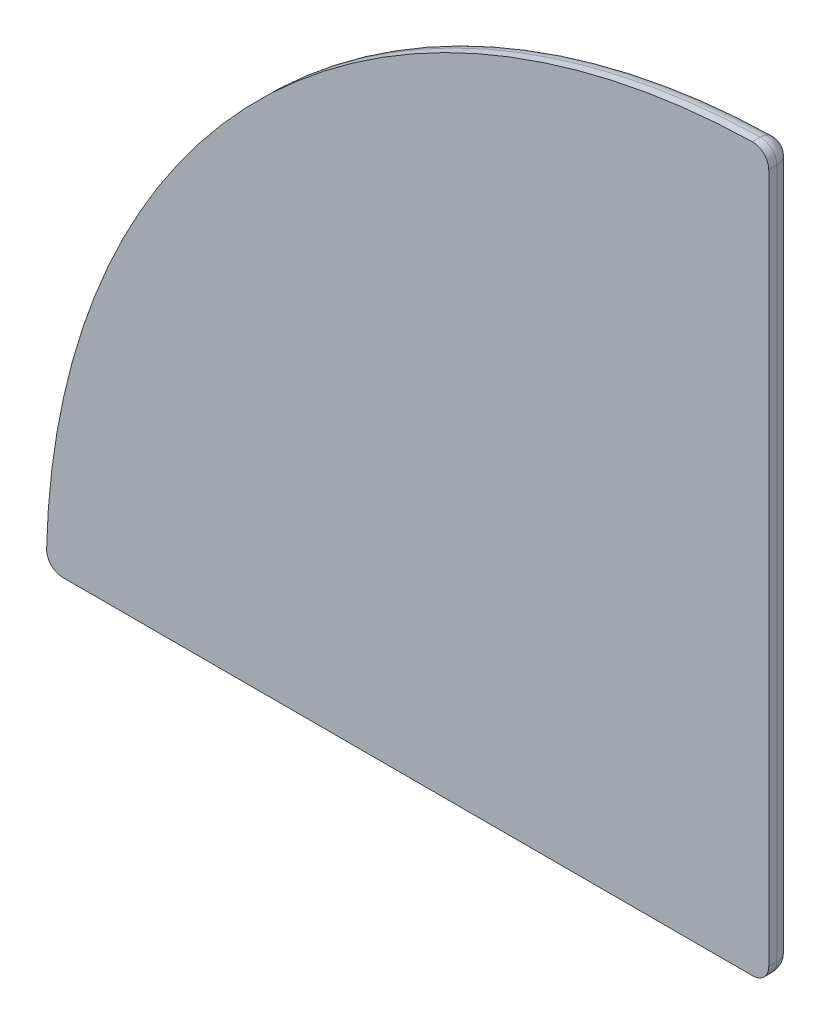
from build123d import *

# Parameters (mm, degrees)
SKETCH1_W          = 90
SKETCH1_H          = 3
REVOLVE1_ANGLE     = 90
FILLET1_R          = 2
CUT_EXTRUDE1_DEPTH = 0.5


with BuildPart() as part:
    # Sketch1 → Revolve1 (revolve)
    with BuildSketch(Plane.XZ):
        with Locations((-45, 1.5)):
            Rectangle(SKETCH1_W, SKETCH1_H)
    revolve(axis=Axis((0, 0, 0), (0, 0, -1)), revolution_arc=REVOLVE1_ANGLE)

    # Fillet1
    fillet1_edges = [part.edges().sort_by_distance(p)[0] for p in [
        (0, 90, 1.5),
        (0, 45, 0),
        (-45, 0, 0),
        (-90, 0, 1.5),
        (0, 0, 1.5),
        (-63.639610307, 63.639610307, 0),
    ]]
    fillet(fillet1_edges, radius=FILLET1_R)

    # Sketch3 → Cut-Extrude1 (cut)
    # profile 1 of 8: a face of its own
    with BuildSketch(Plane(origin=(0, 0, 0), x_dir=(-1, 0, 0), z_dir=(0, 0, -1))):
        with BuildLine():
            Line((29.601520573, 41.86171406), (28.720444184, 41.86171406))
            add(Edge.make_bspline(
                [(28.720444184, 41.86171406), (28.695646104, 41.860691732), (28.649408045, 41.858785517), (28.595513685, 41.837038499), (28.560154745, 41.81033552), (28.533359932, 41.785122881), (28.507017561, 41.752955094), (28.490603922, 41.728683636), (28.48194592, 41.715880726)],
                knots=[0, 0, 0, 0, 1.508597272, 2.812903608, 3.465790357, 4.209986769, 5.055789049, 6, 6, 6, 6], degree=3))
            Line((28.48194592, 41.715880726), (28.384723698, 41.715880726))
            Line((28.384723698, 41.715880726), (28.649046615, 42.493658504))
            Line((28.649046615, 42.493658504), (28.746268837, 42.493658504))
            add(Edge.make_bspline(
                [(28.746268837, 42.493658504), (28.746226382, 42.480745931), (28.746148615, 42.457093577), (28.750164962, 42.424317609), (28.759288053, 42.398427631), (28.771417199, 42.377248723), (28.791315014, 42.36378538), (28.815803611, 42.353926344), (28.846887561, 42.349338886), (28.869310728, 42.348357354), (28.88146849, 42.347825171)],
                knots=[0, 0, 0, 0, 1.312084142, 2.403384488, 3.330811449, 4.094288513, 4.829961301, 5.718401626, 6.762925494, 8, 8, 8, 8], degree=3))
            Line((28.88146849, 42.347825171), (30.544120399, 42.347825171))
            Line((30.544120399, 42.347825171), (30.511459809, 42.250602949))
            add(Edge.make_bspline(
                [(30.511459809, 42.250602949), (30.497436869, 42.246587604), (30.470747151, 42.238945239), (30.434238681, 42.2235866), (30.402824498, 42.206995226), (30.367280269, 42.182591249), (30.331274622, 42.139397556), (30.314565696, 42.098042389), (30.305622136, 42.075906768)],
                knots=[0, 0, 0, 0, 0.925466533, 1.761430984, 2.50945134, 3.178501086, 4.489774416, 6, 6, 6, 6], degree=3))
            Line((30.305622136, 42.075906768), (30.077757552, 41.404465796))
            add(Edge.make_bspline(
                [(30.077757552, 41.404465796), (30.074208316, 41.392899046), (30.067729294, 41.371784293), (30.062260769, 41.341070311), (30.063887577, 41.314745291), (30.06958138, 41.291376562), (30.083794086, 41.27224665), (30.10485602, 41.256216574), (30.131935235, 41.241193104), (30.153065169, 41.233745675), (30.164346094, 41.229769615)],
                knots=[0, 0, 0, 0, 1.26366306, 2.306778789, 3.233532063, 4.003346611, 4.78083917, 5.664355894, 6.753038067, 8, 8, 8, 8], degree=3))
            Line((30.164346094, 41.229769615), (30.130925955, 41.132547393))
            add(Edge.make_bspline(
                [(30.130925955, 41.132547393), (30.033084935, 41.086100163), (29.841913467, 40.995346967), (29.555128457, 40.877018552), (29.27698999, 40.77618319), (29.006832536, 40.693637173), (28.744415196, 40.629285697), (28.489990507, 40.583751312), (28.243614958, 40.55472849), (28.081991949, 40.551029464), (28.002670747, 40.54921406)],
                knots=[0, 0, 0, 0, 1.168033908, 2.282220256, 3.344724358, 4.358042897, 5.327706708, 6.25709569, 7.144618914, 8, 8, 8, 8], degree=3))
            add(Edge.make_bspline(
                [(28.002670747, 40.54921406), (27.934258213, 40.550208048), (27.801960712, 40.552130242), (27.610611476, 40.571736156), (27.433011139, 40.601765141), (27.269635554, 40.646582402), (27.118958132, 40.700585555), (26.983715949, 40.770883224), (26.86105599, 40.851568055), (26.790397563, 40.916607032), (26.755491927, 40.948736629)],
                knots=[0, 0, 0, 0, 1.221886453, 2.362907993, 3.433081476, 4.436038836, 5.386387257, 6.286670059, 7.153605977, 8, 8, 8, 8], degree=3))
            add(Edge.make_bspline(
                [(26.755491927, 40.948736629), (26.735392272, 40.969947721), (26.695564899, 41.0119774), (26.642426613, 41.07998492), (26.595154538, 41.150791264), (26.553834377, 41.224520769), (26.519607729, 41.301918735), (26.491395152, 41.3821284), (26.470513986, 41.46564976), (26.454011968, 41.551531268), (26.445357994, 41.640995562), (26.442074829, 41.733362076), (26.446279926, 41.828758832), (26.456267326, 41.927135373), (26.472234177, 42.028560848), (26.494451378, 42.133286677), (26.523199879, 42.240759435), (26.546777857, 42.312738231), (26.558768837, 42.349344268)],
                knots=[0, 0, 0, 0, 0.936532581, 1.855734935, 2.763103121, 3.664349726, 4.561969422, 5.47339582, 6.386988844, 7.320031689, 8.274822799, 9.265753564, 10.281317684, 11.333846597, 12.434938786, 13.571751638, 14.765073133, 16, 16, 16, 16], degree=3))
            add(Edge.make_bspline(
                [(26.558768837, 42.349344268), (26.583615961, 42.417705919), (26.632808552, 42.553049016), (26.727763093, 42.74599041), (26.836316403, 42.928898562), (26.960367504, 43.101217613), (27.100511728, 43.26178164), (27.254104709, 43.413069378), (27.42419321, 43.552445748), (27.546533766, 43.635666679), (27.608465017, 43.677794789)],
                knots=[0, 0, 0, 0, 1.010588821, 2.000774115, 2.984122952, 3.964923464, 4.948026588, 5.943639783, 6.959029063, 8, 8, 8, 8], degree=3))
            add(Edge.make_bspline(
                [(27.608465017, 43.677794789), (27.669671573, 43.715516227), (27.791538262, 43.790622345), (27.984311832, 43.885168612), (28.183184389, 43.96623073), (28.388890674, 44.032128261), (28.601407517, 44.083272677), (28.820477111, 44.119375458), (29.046321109, 44.142027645), (29.199159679, 44.144955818), (29.276433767, 44.146436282)],
                knots=[0, 0, 0, 0, 0.981709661, 1.954655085, 2.929001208, 3.913442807, 4.902509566, 5.912373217, 6.944510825, 8, 8, 8, 8], degree=3))
            add(Edge.make_bspline(
                [(29.276433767, 44.146436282), (29.325057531, 44.145584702), (29.420379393, 44.143915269), (29.559920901, 44.134463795), (29.692762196, 44.116752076), (29.8212004, 44.092310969), (29.949336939, 44.058587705), (30.081549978, 44.0169154), (30.219241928, 43.964873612), (30.31186037, 43.924783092), (30.359550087, 43.904140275)],
                knots=[0, 0, 0, 0, 1.042667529, 2.044041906, 2.996855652, 3.914614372, 4.845525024, 5.836188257, 6.8858421, 8, 8, 8, 8], degree=3))
            add(Edge.make_bspline(
                [(30.359550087, 43.904140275), (30.382723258, 43.893717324), (30.425552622, 43.874453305), (30.486262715, 43.852081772), (30.537930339, 43.837995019), (30.569632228, 43.835404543), (30.583616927, 43.834261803)],
                knots=[0, 0, 0, 0, 1.29097748, 2.386024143, 3.288024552, 4, 4, 4, 4], degree=3))
            add(Edge.make_bspline(
                [(30.583616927, 43.834261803), (30.593575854, 43.835123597), (30.615549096, 43.837025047), (30.649755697, 43.849898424), (30.688840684, 43.868012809), (30.715197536, 43.884559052), (30.729450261, 43.893506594)],
                knots=[0, 0, 0, 0, 0.750766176, 1.65648045, 2.732719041, 4, 4, 4, 4], degree=3))
            Line((30.729450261, 43.893506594), (30.813000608, 43.854769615))
            Line((30.813000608, 43.854769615), (30.114975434, 43.016227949))
            Line((30.114975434, 43.016227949), (30.054211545, 43.055724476))
            add(Edge.make_bspline(
                [(30.054211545, 43.055724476), (30.05786836, 43.069106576), (30.064521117, 43.093452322), (30.072120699, 43.127358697), (30.07434972, 43.155391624), (30.073747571, 43.179397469), (30.065299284, 43.200996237), (30.053361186, 43.223795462), (30.034407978, 43.247961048), (30.019637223, 43.26420242), (30.011676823, 43.272955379)],
                knots=[0, 0, 0, 0, 1.395800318, 2.539347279, 3.484551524, 4.224717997, 4.925283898, 5.791008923, 6.809508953, 8, 8, 8, 8], degree=3))
            add(Edge.make_bspline(
                [(30.011676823, 43.272955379), (29.989434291, 43.292902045), (29.941672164, 43.335734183), (29.852143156, 43.389307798), (29.74286181, 43.436615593), (29.617963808, 43.480351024), (29.483669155, 43.516666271), (29.34661236, 43.543306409), (29.210008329, 43.560017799), (29.11900022, 43.562076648), (29.073634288, 43.563102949)],
                knots=[0, 0, 0, 0, 0.715040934, 1.535431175, 2.48643065, 3.567273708, 4.705518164, 5.818607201, 6.9126143, 8, 8, 8, 8], degree=3))
            add(Edge.make_bspline(
                [(29.073634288, 43.563102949), (29.028023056, 43.562297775), (28.937579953, 43.560701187), (28.803255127, 43.545747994), (28.671817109, 43.521421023), (28.542548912, 43.487853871), (28.416112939, 43.4446784), (28.29227783, 43.391807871), (28.170961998, 43.32968719), (28.093468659, 43.280894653), (28.054320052, 43.25624531)],
                knots=[0, 0, 0, 0, 1.013375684, 2.00943578, 2.999374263, 3.981993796, 4.974886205, 5.96565587, 6.97227632, 8, 8, 8, 8], degree=3))
            add(Edge.make_bspline(
                [(28.054320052, 43.25624531), (28.011545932, 43.226783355), (27.927161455, 43.168661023), (27.810455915, 43.070842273), (27.704951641, 42.965562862), (27.60829542, 42.85453224), (27.52318396, 42.735589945), (27.44853618, 42.609800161), (27.384123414, 42.47715694), (27.349963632, 42.384596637), (27.332748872, 42.337951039)],
                knots=[0, 0, 0, 0, 1.047083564, 2.065678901, 3.065830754, 4.050574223, 5.031178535, 6.011104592, 6.997699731, 8, 8, 8, 8], degree=3))
            add(Edge.make_bspline(
                [(27.332748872, 42.337951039), (27.318749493, 42.293112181), (27.291824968, 42.206875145), (27.266150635, 42.077911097), (27.255998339, 41.955549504), (27.260289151, 41.839453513), (27.278690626, 41.72997876), (27.313885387, 41.627291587), (27.362719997, 41.530623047), (27.406973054, 41.473452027), (27.429211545, 41.444721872)],
                knots=[0, 0, 0, 0, 1.196515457, 2.301217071, 3.343419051, 4.318485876, 5.25515961, 6.16110544, 7.075900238, 8, 8, 8, 8], degree=3))
            add(Edge.make_bspline(
                [(27.429211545, 41.444721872), (27.451813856, 41.419699), (27.49753981, 41.369076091), (27.579737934, 41.305665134), (27.672312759, 41.251921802), (27.775192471, 41.208152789), (27.888534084, 41.173891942), (28.012270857, 41.150319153), (28.146322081, 41.134469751), (28.239347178, 41.133203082), (28.287501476, 41.132547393)],
                knots=[0, 0, 0, 0, 0.856531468, 1.732819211, 2.627732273, 3.574227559, 4.570698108, 5.634421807, 6.7754621, 8, 8, 8, 8], degree=3))
            add(Edge.make_bspline(
                [(28.287501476, 41.132547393), (28.33638506, 41.133583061), (28.435053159, 41.135673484), (28.583989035, 41.147776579), (28.734433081, 41.169629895), (28.885355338, 41.197985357), (29.033370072, 41.234164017), (29.175800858, 41.276407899), (29.310408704, 41.325657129), (29.396131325, 41.363741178), (29.438217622, 41.382438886)],
                knots=[0, 0, 0, 0, 0.989157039, 1.996544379, 3.020928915, 4.063796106, 5.102490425, 6.102465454, 7.068388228, 8, 8, 8, 8], degree=3))
            Line((29.438217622, 41.382438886), (29.601520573, 41.86171406))
        make_face()
    # profile 2 of 8: a face of its own
    with BuildSketch(Plane(origin=(0, 0, 0), x_dir=(-1, 0, 0), z_dir=(0, 0, -1))):
        with BuildLine():
            Line((31.755600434, 41.764491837), (31.454819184, 40.880377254))
            add(Edge.make_bspline(
                [(31.454819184, 40.880377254), (31.451233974, 40.868302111), (31.444661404, 40.846165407), (31.439625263, 40.814191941), (31.440111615, 40.786664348), (31.445646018, 40.762126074), (31.460441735, 40.742363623), (31.479568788, 40.723468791), (31.506895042, 40.708188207), (31.527396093, 40.699628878), (31.538369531, 40.695047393)],
                knots=[0, 0, 0, 0, 1.279442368, 2.345532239, 3.272103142, 4.070919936, 4.848744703, 5.740365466, 6.790502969, 8, 8, 8, 8], degree=3))
            Line((31.538369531, 40.695047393), (31.504949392, 40.597825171))
            Line((31.504949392, 40.597825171), (30.53272717, 40.597825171))
            Line((30.53272717, 40.597825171), (30.566147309, 40.695047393))
            add(Edge.make_bspline(
                [(30.566147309, 40.695047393), (30.579903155, 40.699102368), (30.606294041, 40.706881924), (30.642779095, 40.721970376), (30.674325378, 40.73933686), (30.710293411, 40.766675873), (30.747944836, 40.812965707), (30.765617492, 40.857457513), (30.775023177, 40.881136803)],
                knots=[0, 0, 0, 0, 0.87830476, 1.685046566, 2.414382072, 3.078421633, 4.445086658, 6, 6, 6, 6], degree=3))
            Line((30.775023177, 40.881136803), (31.556598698, 43.182569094))
            add(Edge.make_bspline(
                [(31.556598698, 43.182569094), (31.56052939, 43.194623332), (31.567873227, 43.217144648), (31.572410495, 43.249526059), (31.572098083, 43.277327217), (31.566373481, 43.301320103), (31.552629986, 43.321594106), (31.533288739, 43.340185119), (31.506066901, 43.355534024), (31.48554959, 43.364082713), (31.474567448, 43.368658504)],
                knots=[0, 0, 0, 0, 1.283517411, 2.398036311, 3.296865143, 4.093887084, 4.855825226, 5.745442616, 6.793220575, 8, 8, 8, 8], degree=3))
            Line((31.474567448, 43.368658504), (31.507228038, 43.465880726))
            Line((31.507228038, 43.465880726), (33.369641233, 43.465880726))
            add(Edge.make_bspline(
                [(33.369641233, 43.465880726), (33.399010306, 43.465664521), (33.45572667, 43.465246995), (33.537782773, 43.464044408), (33.613981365, 43.460708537), (33.684412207, 43.457260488), (33.749265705, 43.451980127), (33.808248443, 43.445092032), (33.861450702, 43.437578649), (33.923679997, 43.426837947), (33.994439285, 43.408653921), (34.072434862, 43.378971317), (34.143415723, 43.342114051), (34.184784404, 43.310527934), (34.205144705, 43.294982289)],
                knots=[0, 0, 0, 0, 1.215902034, 2.348100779, 3.397091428, 4.373281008, 5.267226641, 6.090209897, 6.831365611, 7.491368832, 8.704013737, 9.848613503, 10.941158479, 12, 12, 12, 12], degree=3))
            add(Edge.make_bspline(
                [(34.205144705, 43.294982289), (34.223600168, 43.277661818), (34.260332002, 43.243188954), (34.302545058, 43.1795299), (34.331762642, 43.107714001), (34.347013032, 43.02808494), (34.351721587, 42.941142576), (34.342200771, 42.846325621), (34.321703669, 42.74349543), (34.299538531, 42.673732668), (34.287935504, 42.637213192)],
                knots=[0, 0, 0, 0, 0.857133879, 1.705950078, 2.569611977, 3.47329217, 4.446091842, 5.516273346, 6.699816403, 8, 8, 8, 8], degree=3))
            add(Edge.make_bspline(
                [(34.287935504, 42.637213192), (34.277640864, 42.608975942), (34.257367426, 42.553367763), (34.221513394, 42.473349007), (34.181466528, 42.398024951), (34.136319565, 42.327804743), (34.086904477, 42.262197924), (34.032755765, 42.201556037), (33.975137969, 42.144858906), (33.912040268, 42.093683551), (33.843893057, 42.046410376), (33.770038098, 42.00202516), (33.689552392, 41.962241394), (33.603051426, 41.925516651), (33.510594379, 41.892564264), (33.412192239, 41.861754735), (33.307348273, 41.835468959), (33.235007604, 41.820674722), (33.197983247, 41.813102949)],
                knots=[0, 0, 0, 0, 0.998792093, 1.966941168, 2.91198992, 3.831782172, 4.739014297, 5.639192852, 6.531905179, 7.42306907, 8.33590481, 9.287041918, 10.284414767, 11.317643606, 12.409108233, 13.545743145, 14.743897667, 16, 16, 16, 16], degree=3))
            Line((33.197983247, 41.813102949), (33.498764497, 41.063428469))
            add(Edge.make_bspline(
                [(33.498764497, 41.063428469), (33.512182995, 41.032179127), (33.536859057, 40.97471288), (33.574395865, 40.897050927), (33.610773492, 40.836270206), (33.644766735, 40.788374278), (33.682210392, 40.752994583), (33.724714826, 40.727125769), (33.77147064, 40.705954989), (33.805680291, 40.698726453), (33.823091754, 40.695047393)],
                knots=[0, 0, 0, 0, 1.580752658, 2.906938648, 4.004793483, 4.870887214, 5.628500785, 6.379413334, 7.175180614, 8, 8, 8, 8], degree=3))
            Line((33.823091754, 40.695047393), (33.789671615, 40.597825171))
            Line((33.789671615, 40.597825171), (32.494641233, 40.597825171))
            Line((32.494641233, 40.597825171), (32.528061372, 40.695047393))
            add(Edge.make_bspline(
                [(32.528061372, 40.695047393), (32.550957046, 40.700722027), (32.592626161, 40.711049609), (32.644646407, 40.737493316), (32.685527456, 40.766396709), (32.698307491, 40.793351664), (32.704276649, 40.80594149)],
                knots=[0, 0, 0, 0, 1.302264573, 2.370063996, 3.238707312, 4, 4, 4, 4], degree=3))
            add(Edge.make_bspline(
                [(32.704276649, 40.80594149), (32.706649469, 40.816285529), (32.711888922, 40.839126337), (32.70598467, 40.878058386), (32.693880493, 40.923256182), (32.679971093, 40.954475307), (32.672375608, 40.971523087)],
                knots=[0, 0, 0, 0, 0.734497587, 1.621853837, 2.701369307, 4, 4, 4, 4], degree=3))
            Line((32.672375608, 40.971523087), (32.370075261, 41.764491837))
            Line((32.370075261, 41.764491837), (31.755600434, 41.764491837))
        make_face()
        with BuildLine():
            Line((31.937132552, 42.29921406), (32.980752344, 42.29921406))
            add(Edge.make_bspline(
                [(32.980752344, 42.29921406), (33.018264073, 42.299584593), (33.088877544, 42.300282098), (33.187955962, 42.310904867), (33.274511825, 42.324139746), (33.326002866, 42.341356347), (33.349892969, 42.349344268)],
                knots=[0, 0, 0, 0, 1.201770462, 2.262257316, 3.193746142, 4, 4, 4, 4], degree=3))
            add(Edge.make_bspline(
                [(33.349892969, 42.349344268), (33.378817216, 42.361884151), (33.435753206, 42.386568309), (33.50689622, 42.447793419), (33.564561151, 42.524044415), (33.588257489, 42.584065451), (33.600544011, 42.615186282)],
                knots=[0, 0, 0, 0, 0.995730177, 1.960046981, 2.942286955, 4, 4, 4, 4], degree=3))
            add(Edge.make_bspline(
                [(33.600544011, 42.615186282), (33.605212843, 42.629271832), (33.614106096, 42.656102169), (33.621116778, 42.695745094), (33.625825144, 42.731789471), (33.624252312, 42.764623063), (33.618243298, 42.794172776), (33.607714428, 42.820403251), (33.59199503, 42.843080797), (33.571469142, 42.862458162), (33.545809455, 42.879769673), (33.513399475, 42.89245798), (33.475798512, 42.905128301), (33.431691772, 42.914488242), (33.381476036, 42.922081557), (33.324893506, 42.926950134), (33.262354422, 42.931213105), (33.218499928, 42.931177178), (33.195704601, 42.931158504)],
                knots=[0, 0, 0, 0, 1.089736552, 2.075744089, 2.955845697, 3.757392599, 4.480481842, 5.165149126, 5.821108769, 6.492738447, 7.231247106, 8.082103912, 9.041917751, 10.148702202, 11.391681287, 12.775749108, 14.324051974, 16, 16, 16, 16], degree=3))
            Line((33.195704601, 42.931158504), (32.152084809, 42.931158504))
            Line((32.152084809, 42.931158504), (31.937132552, 42.29921406))
        make_face(mode=Mode.SUBTRACT)
    # profile 3 of 8: a face of its own
    with BuildSketch(Plane(origin=(0, 0, 0), x_dir=(-1, 0, 0), z_dir=(0, 0, -1))):
        with BuildLine():
            Line((35.352822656, 41.764491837), (35.137870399, 41.132547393))
            Line((35.137870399, 41.132547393), (36.899263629, 41.132547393))
            add(Edge.make_bspline(
                [(36.899263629, 41.132547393), (36.923055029, 41.133629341), (36.967488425, 41.135650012), (37.019467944, 41.156995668), (37.05448492, 41.18315894), (37.080756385, 41.20917322), (37.107422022, 41.241255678), (37.123803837, 41.265560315), (37.132445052, 41.278380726)],
                knots=[0, 0, 0, 0, 1.471494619, 2.748198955, 3.412112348, 4.179755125, 5.039842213, 6, 6, 6, 6], degree=3))
            Line((37.132445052, 41.278380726), (37.229667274, 41.278380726))
            Line((37.229667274, 41.278380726), (36.948634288, 40.451991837))
            Line((36.948634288, 40.451991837), (36.851412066, 40.451991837))
            add(Edge.make_bspline(
                [(36.851412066, 40.451991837), (36.851819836, 40.464421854), (36.852572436, 40.487363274), (36.847844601, 40.518788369), (36.840294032, 40.545141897), (36.825614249, 40.565151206), (36.80637945, 40.580140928), (36.781737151, 40.591102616), (36.751123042, 40.596466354), (36.728887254, 40.597351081), (36.716971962, 40.597825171)],
                knots=[0, 0, 0, 0, 1.270497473, 2.344889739, 3.24681471, 4.045564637, 4.839248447, 5.721199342, 6.778879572, 8, 8, 8, 8], degree=3))
            Line((36.716971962, 40.597825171), (34.129949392, 40.597825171))
            Line((34.129949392, 40.597825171), (34.163369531, 40.695047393))
            add(Edge.make_bspline(
                [(34.163369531, 40.695047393), (34.177125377, 40.699102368), (34.203516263, 40.706881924), (34.240001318, 40.721970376), (34.271547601, 40.73933686), (34.307515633, 40.766675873), (34.345167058, 40.812965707), (34.362839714, 40.857457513), (34.372245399, 40.881136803)],
                knots=[0, 0, 0, 0, 0.87830476, 1.685046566, 2.414382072, 3.078421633, 4.445086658, 6, 6, 6, 6], degree=3))
            Line((34.372245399, 40.881136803), (35.15382092, 43.182569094))
            add(Edge.make_bspline(
                [(35.15382092, 43.182569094), (35.157751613, 43.194623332), (35.16509545, 43.217144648), (35.169632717, 43.249526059), (35.169320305, 43.277327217), (35.163595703, 43.301320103), (35.149852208, 43.321594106), (35.130510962, 43.340185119), (35.103289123, 43.355534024), (35.082771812, 43.364082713), (35.07178967, 43.368658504)],
                knots=[0, 0, 0, 0, 1.283517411, 2.398036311, 3.296865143, 4.093887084, 4.855825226, 5.745442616, 6.793220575, 8, 8, 8, 8], degree=3))
            Line((35.07178967, 43.368658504), (35.104450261, 43.465880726))
            Line((35.104450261, 43.465880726), (37.593491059, 43.465880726))
            add(Edge.make_bspline(
                [(37.593491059, 43.465880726), (37.617763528, 43.467313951), (37.663103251, 43.469991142), (37.716305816, 43.490793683), (37.751747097, 43.517019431), (37.776952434, 43.543527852), (37.804263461, 43.574382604), (37.819916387, 43.598803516), (37.82819158, 43.61171406)],
                knots=[0, 0, 0, 0, 1.497028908, 2.79637307, 3.456985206, 4.20966196, 5.0535064, 6, 6, 6, 6], degree=3))
            Line((37.82819158, 43.61171406), (37.925413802, 43.61171406))
            Line((37.925413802, 43.61171406), (37.644380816, 42.785325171))
            Line((37.644380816, 42.785325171), (37.547158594, 42.785325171))
            add(Edge.make_bspline(
                [(37.547158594, 42.785325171), (37.547513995, 42.797987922), (37.548170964, 42.821395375), (37.544050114, 42.853644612), (37.534938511, 42.879549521), (37.521737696, 42.900000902), (37.502303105, 42.914487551), (37.477994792, 42.925112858), (37.447047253, 42.929660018), (37.4248751, 42.930627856), (37.41271849, 42.931158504)],
                knots=[0, 0, 0, 0, 1.291887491, 2.388090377, 3.295359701, 4.076497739, 4.83111929, 5.733593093, 6.757368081, 8, 8, 8, 8], degree=3))
            Line((37.41271849, 42.931158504), (35.749307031, 42.931158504))
            Line((35.749307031, 42.931158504), (35.534354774, 42.29921406))
            Line((35.534354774, 42.29921406), (36.566581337, 42.29921406))
            add(Edge.make_bspline(
                [(36.566581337, 42.29921406), (36.589832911, 42.30072293), (36.633905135, 42.303582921), (36.685843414, 42.324233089), (36.72105807, 42.350581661), (36.747091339, 42.376535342), (36.774215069, 42.408153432), (36.790876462, 42.432214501), (36.799762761, 42.445047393)],
                knots=[0, 0, 0, 0, 1.446319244, 2.741427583, 3.407321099, 4.177253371, 5.027844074, 6, 6, 6, 6], degree=3))
            Line((36.799762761, 42.445047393), (36.896984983, 42.445047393))
            Line((36.896984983, 42.445047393), (36.615951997, 41.618658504))
            Line((36.615951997, 41.618658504), (36.518729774, 41.618658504))
            add(Edge.make_bspline(
                [(36.518729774, 41.618658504), (36.518817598, 41.631088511), (36.518979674, 41.654027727), (36.514345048, 41.685687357), (36.5069114, 41.712152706), (36.492992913, 41.732462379), (36.474523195, 41.747915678), (36.449564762, 41.757463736), (36.419247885, 41.763235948), (36.396981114, 41.764053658), (36.385049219, 41.764491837)],
                knots=[0, 0, 0, 0, 1.274023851, 2.351173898, 3.280111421, 4.06600575, 4.841513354, 5.71535005, 6.775745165, 8, 8, 8, 8], degree=3))
            Line((36.385049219, 41.764491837), (35.352822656, 41.764491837))
        make_face()
    # profile 4 of 8: a face of its own
    with BuildSketch(Plane(origin=(0, 0, 0), x_dir=(-1, 0, 0), z_dir=(0, 0, -1))):
        with BuildLine():
            Line((38.706989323, 41.764491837), (38.492037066, 41.132547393))
            Line((38.492037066, 41.132547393), (40.253430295, 41.132547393))
            add(Edge.make_bspline(
                [(40.253430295, 41.132547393), (40.277221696, 41.133629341), (40.321655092, 41.135650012), (40.373634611, 41.156995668), (40.408651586, 41.18315894), (40.434923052, 41.20917322), (40.461588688, 41.241255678), (40.477970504, 41.265560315), (40.486611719, 41.278380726)],
                knots=[0, 0, 0, 0, 1.471494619, 2.748198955, 3.412112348, 4.179755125, 5.039842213, 6, 6, 6, 6], degree=3))
            Line((40.486611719, 41.278380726), (40.583833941, 41.278380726))
            Line((40.583833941, 41.278380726), (40.302800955, 40.451991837))
            Line((40.302800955, 40.451991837), (40.205578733, 40.451991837))
            add(Edge.make_bspline(
                [(40.205578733, 40.451991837), (40.205986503, 40.464421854), (40.206739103, 40.487363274), (40.202011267, 40.518788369), (40.194460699, 40.545141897), (40.179780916, 40.565151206), (40.160546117, 40.580140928), (40.135903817, 40.591102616), (40.105289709, 40.596466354), (40.08305392, 40.597351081), (40.071138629, 40.597825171)],
                knots=[0, 0, 0, 0, 1.270497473, 2.344889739, 3.24681471, 4.045564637, 4.839248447, 5.721199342, 6.778879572, 8, 8, 8, 8], degree=3))
            Line((40.071138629, 40.597825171), (37.484116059, 40.597825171))
            Line((37.484116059, 40.597825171), (37.517536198, 40.695047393))
            add(Edge.make_bspline(
                [(37.517536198, 40.695047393), (37.531292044, 40.699102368), (37.55768293, 40.706881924), (37.594167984, 40.721970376), (37.625714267, 40.73933686), (37.6616823, 40.766675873), (37.699333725, 40.812965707), (37.71700638, 40.857457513), (37.726412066, 40.881136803)],
                knots=[0, 0, 0, 0, 0.87830476, 1.685046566, 2.414382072, 3.078421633, 4.445086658, 6, 6, 6, 6], degree=3))
            Line((37.726412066, 40.881136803), (38.507987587, 43.182569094))
            add(Edge.make_bspline(
                [(38.507987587, 43.182569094), (38.511918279, 43.194623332), (38.519262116, 43.217144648), (38.523799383, 43.249526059), (38.523486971, 43.277327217), (38.51776237, 43.301320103), (38.504018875, 43.321594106), (38.484677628, 43.340185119), (38.45745579, 43.355534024), (38.436938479, 43.364082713), (38.425956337, 43.368658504)],
                knots=[0, 0, 0, 0, 1.283517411, 2.398036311, 3.296865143, 4.093887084, 4.855825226, 5.745442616, 6.793220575, 8, 8, 8, 8], degree=3))
            Line((38.425956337, 43.368658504), (38.458616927, 43.465880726))
            Line((38.458616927, 43.465880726), (40.947657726, 43.465880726))
            add(Edge.make_bspline(
                [(40.947657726, 43.465880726), (40.971930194, 43.467313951), (41.017269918, 43.469991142), (41.070472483, 43.490793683), (41.105913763, 43.517019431), (41.131119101, 43.543527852), (41.158430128, 43.574382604), (41.174083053, 43.598803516), (41.182358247, 43.61171406)],
                knots=[0, 0, 0, 0, 1.497028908, 2.79637307, 3.456985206, 4.20966196, 5.0535064, 6, 6, 6, 6], degree=3))
            Line((41.182358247, 43.61171406), (41.279580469, 43.61171406))
            Line((41.279580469, 43.61171406), (40.998547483, 42.785325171))
            Line((40.998547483, 42.785325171), (40.901325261, 42.785325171))
            add(Edge.make_bspline(
                [(40.901325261, 42.785325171), (40.901680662, 42.797987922), (40.902337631, 42.821395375), (40.898216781, 42.853644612), (40.889105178, 42.879549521), (40.875904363, 42.900000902), (40.856469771, 42.914487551), (40.832161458, 42.925112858), (40.801213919, 42.929660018), (40.779041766, 42.930627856), (40.766885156, 42.931158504)],
                knots=[0, 0, 0, 0, 1.291887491, 2.388090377, 3.295359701, 4.076497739, 4.83111929, 5.733593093, 6.757368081, 8, 8, 8, 8], degree=3))
            Line((40.766885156, 42.931158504), (39.103473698, 42.931158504))
            Line((39.103473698, 42.931158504), (38.888521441, 42.29921406))
            Line((38.888521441, 42.29921406), (39.920748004, 42.29921406))
            add(Edge.make_bspline(
                [(39.920748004, 42.29921406), (39.943999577, 42.30072293), (39.988071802, 42.303582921), (40.040010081, 42.324233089), (40.075224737, 42.350581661), (40.101258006, 42.376535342), (40.128381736, 42.408153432), (40.145043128, 42.432214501), (40.153929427, 42.445047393)],
                knots=[0, 0, 0, 0, 1.446319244, 2.741427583, 3.407321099, 4.177253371, 5.027844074, 6, 6, 6, 6], degree=3))
            Line((40.153929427, 42.445047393), (40.251151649, 42.445047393))
            Line((40.251151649, 42.445047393), (39.970118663, 41.618658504))
            Line((39.970118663, 41.618658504), (39.872896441, 41.618658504))
            add(Edge.make_bspline(
                [(39.872896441, 41.618658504), (39.872984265, 41.631088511), (39.873146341, 41.654027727), (39.868511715, 41.685687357), (39.861078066, 41.712152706), (39.84715958, 41.732462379), (39.828689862, 41.747915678), (39.803731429, 41.757463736), (39.773414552, 41.763235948), (39.75114778, 41.764053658), (39.739215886, 41.764491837)],
                knots=[0, 0, 0, 0, 1.274023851, 2.351173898, 3.280111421, 4.06600575, 4.841513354, 5.71535005, 6.775745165, 8, 8, 8, 8], degree=3))
            Line((39.739215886, 41.764491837), (38.706989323, 41.764491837))
        make_face()
    # profile 5 of 8: a face of its own
    with BuildSketch(Plane(origin=(0, 0, 0), x_dir=(-1, 0, 0), z_dir=(0, 0, -1))):
        with BuildLine():
            Line((42.255600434, 42.47922708), (41.713282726, 40.883415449))
            add(Edge.make_bspline(
                [(41.713282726, 40.883415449), (41.709368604, 40.871103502), (41.702195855, 40.848541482), (41.697379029, 40.81571458), (41.69775134, 40.787384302), (41.703597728, 40.762131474), (41.717348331, 40.740955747), (41.737568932, 40.723109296), (41.763724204, 40.707031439), (41.784258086, 40.699241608), (41.795313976, 40.695047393)],
                knots=[0, 0, 0, 0, 1.2947723, 2.37271004, 3.313121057, 4.126549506, 4.937195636, 5.800294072, 6.815630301, 8, 8, 8, 8], degree=3))
            Line((41.795313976, 40.695047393), (41.761893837, 40.597825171))
            Line((41.761893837, 40.597825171), (40.838282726, 40.597825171))
            Line((40.838282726, 40.597825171), (40.871702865, 40.695047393))
            add(Edge.make_bspline(
                [(40.871702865, 40.695047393), (40.885458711, 40.699102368), (40.911849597, 40.706881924), (40.948334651, 40.721970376), (40.979880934, 40.73933686), (41.015848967, 40.766675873), (41.053500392, 40.812965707), (41.071173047, 40.857457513), (41.080578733, 40.881136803)],
                knots=[0, 0, 0, 0, 0.87830476, 1.685046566, 2.414382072, 3.078421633, 4.445086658, 6, 6, 6, 6], degree=3))
            Line((41.080578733, 40.881136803), (41.862154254, 43.182569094))
            add(Edge.make_bspline(
                [(41.862154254, 43.182569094), (41.866084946, 43.194623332), (41.873428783, 43.217144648), (41.87796605, 43.249526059), (41.877653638, 43.277327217), (41.871929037, 43.301320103), (41.858185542, 43.321594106), (41.838844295, 43.340185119), (41.811622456, 43.355534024), (41.791105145, 43.364082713), (41.780123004, 43.368658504)],
                knots=[0, 0, 0, 0, 1.283517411, 2.398036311, 3.296865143, 4.093887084, 4.855825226, 5.745442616, 6.793220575, 8, 8, 8, 8], degree=3))
            Line((41.780123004, 43.368658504), (41.812783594, 43.465880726))
            Line((41.812783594, 43.465880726), (42.89210217, 43.465880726))
            Line((42.89210217, 43.465880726), (42.85944158, 43.368658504))
            add(Edge.make_bspline(
                [(42.85944158, 43.368658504), (42.841240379, 43.363702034), (42.807926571, 43.354630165), (42.764594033, 43.333364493), (42.73172513, 43.305921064), (42.720493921, 43.282072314), (42.715127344, 43.270676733)],
                knots=[0, 0, 0, 0, 1.243469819, 2.27593305, 3.176193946, 4, 4, 4, 4], degree=3))
            add(Edge.make_bspline(
                [(42.715127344, 43.270676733), (42.712802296, 43.260348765), (42.707951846, 43.238802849), (42.711707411, 43.203524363), (42.725387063, 43.166490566), (42.73997718, 43.142827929), (42.747787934, 43.13016024)],
                knots=[0, 0, 0, 0, 0.847282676, 1.767577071, 2.804882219, 4, 4, 4, 4], degree=3))
            Line((42.747787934, 43.13016024), (43.717731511, 41.632330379))
            Line((43.717731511, 41.632330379), (44.244098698, 43.182569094))
            add(Edge.make_bspline(
                [(44.244098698, 43.182569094), (44.24792769, 43.194640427), (44.255092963, 43.217229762), (44.260877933, 43.249698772), (44.260408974, 43.277868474), (44.254453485, 43.302208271), (44.241152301, 43.323014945), (44.221684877, 43.34172058), (44.194056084, 43.356391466), (44.173299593, 43.364351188), (44.162067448, 43.368658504)],
                knots=[0, 0, 0, 0, 1.275253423, 2.386408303, 3.304944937, 4.096835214, 4.875471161, 5.759360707, 6.787502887, 8, 8, 8, 8], degree=3))
            Line((44.162067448, 43.368658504), (44.194728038, 43.465880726))
            Line((44.194728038, 43.465880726), (45.118339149, 43.465880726))
            Line((45.118339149, 43.465880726), (45.085678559, 43.368658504))
            add(Edge.make_bspline(
                [(45.085678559, 43.368658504), (45.071424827, 43.36433087), (45.044570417, 43.356177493), (45.007148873, 43.34095215), (44.97556098, 43.322955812), (44.939744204, 43.29603988), (44.902883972, 43.250031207), (44.885458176, 43.20623297), (44.876043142, 43.182569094)],
                knots=[0, 0, 0, 0, 0.910793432, 1.715958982, 2.464972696, 3.127714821, 4.448124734, 6, 6, 6, 6], degree=3))
            Line((44.876043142, 43.182569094), (44.09522717, 40.883415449))
            add(Edge.make_bspline(
                [(44.09522717, 40.883415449), (44.09125967, 40.871361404), (44.083847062, 40.848840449), (44.079713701, 40.816208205), (44.078780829, 40.787915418), (44.084652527, 40.763013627), (44.098787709, 40.742397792), (44.119015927, 40.724413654), (44.145462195, 40.707959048), (44.166215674, 40.699531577), (44.17725842, 40.695047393)],
                knots=[0, 0, 0, 0, 1.270575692, 2.373856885, 3.288671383, 4.102236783, 4.891631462, 5.754875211, 6.805388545, 8, 8, 8, 8], degree=3))
            Line((44.17725842, 40.695047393), (44.143838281, 40.597825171))
            Line((44.143838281, 40.597825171), (43.13819592, 40.597825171))
            Line((43.13819592, 40.597825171), (43.171616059, 40.695047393))
            add(Edge.make_bspline(
                [(43.171616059, 40.695047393), (43.189566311, 40.699189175), (43.222348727, 40.706753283), (43.264770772, 40.726576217), (43.297262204, 40.752522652), (43.307818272, 40.775775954), (43.312892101, 40.786952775)],
                knots=[0, 0, 0, 0, 1.25007402, 2.283001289, 3.174715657, 4, 4, 4, 4], degree=3))
            add(Edge.make_bspline(
                [(43.312892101, 40.786952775), (43.315561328, 40.798902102), (43.321047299, 40.823461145), (43.308744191, 40.855852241), (43.294063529, 40.88625678), (43.274630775, 40.918272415), (43.249583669, 40.959664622), (43.230189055, 40.989802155), (43.219467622, 41.006462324)],
                knots=[0, 0, 0, 0, 0.879947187, 1.808525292, 2.44809926, 3.371836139, 4.547138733, 6, 6, 6, 6], degree=3))
            Line((43.219467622, 41.006462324), (42.255600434, 42.47922708))
        make_face()
    # profile 6 of 8: a face of its own
    with BuildSketch(Plane(origin=(0, 0, 0), x_dir=(-1, 0, 0), z_dir=(0, 0, -1))):
        with BuildLine():
            Line((45.897636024, 41.181158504), (47.999307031, 41.181158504))
            add(Edge.make_bspline(
                [(47.999307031, 41.181158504), (48.023082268, 41.182601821), (48.067695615, 41.185310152), (48.120020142, 41.206245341), (48.155287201, 41.232289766), (48.180488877, 41.258807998), (48.207801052, 41.289659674), (48.223453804, 41.314081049), (48.231728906, 41.326991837)],
                knots=[0, 0, 0, 0, 1.477160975, 2.771837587, 3.437509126, 4.195950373, 5.046257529, 6, 6, 6, 6], degree=3))
            Line((48.231728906, 41.326991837), (48.328951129, 41.326991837))
            Line((48.328951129, 41.326991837), (48.031967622, 40.451991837))
            Line((48.031967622, 40.451991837), (47.934745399, 40.451991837))
            add(Edge.make_bspline(
                [(47.934745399, 40.451991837), (47.934774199, 40.46465361), (47.93482743, 40.488057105), (47.93091289, 40.520313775), (47.921755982, 40.546209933), (47.908574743, 40.566686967), (47.889286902, 40.580939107), (47.865185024, 40.592081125), (47.834343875, 40.596162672), (47.812197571, 40.597244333), (47.800305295, 40.597825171)],
                knots=[0, 0, 0, 0, 1.295984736, 2.395444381, 3.305409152, 4.088867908, 4.845731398, 5.727205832, 6.779539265, 8, 8, 8, 8], degree=3))
            Line((47.800305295, 40.597825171), (44.775782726, 40.597825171))
            Line((44.775782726, 40.597825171), (44.809202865, 40.695047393))
            add(Edge.make_bspline(
                [(44.809202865, 40.695047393), (44.823457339, 40.699371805), (44.850313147, 40.707519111), (44.887405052, 40.722654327), (44.918617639, 40.740215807), (44.95492935, 40.766016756), (44.990974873, 40.812845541), (45.008114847, 40.85678261), (45.017319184, 40.880377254)],
                knots=[0, 0, 0, 0, 0.914573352, 1.723080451, 2.45401187, 3.110175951, 4.448135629, 6, 6, 6, 6], degree=3))
            Line((45.017319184, 40.880377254), (46.015366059, 43.815273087))
            add(Edge.make_bspline(
                [(46.015366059, 43.815273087), (46.019282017, 43.827586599), (46.02645813, 43.850151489), (46.031217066, 43.882708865), (46.030969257, 43.910589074), (46.024892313, 43.934845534), (46.011891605, 43.955995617), (45.991247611, 43.973083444), (45.964546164, 43.988672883), (45.943873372, 43.996387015), (45.932575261, 44.000602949)],
                knots=[0, 0, 0, 0, 1.303857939, 2.389359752, 3.310793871, 4.105182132, 4.886274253, 5.774427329, 6.783678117, 8, 8, 8, 8], degree=3))
            Line((45.932575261, 44.000602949), (45.965235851, 44.097825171))
            Line((45.965235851, 44.097825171), (47.034680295, 44.097825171))
            Line((47.034680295, 44.097825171), (47.002019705, 44.000602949))
            add(Edge.make_bspline(
                [(47.002019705, 44.000602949), (46.987782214, 43.996503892), (46.960985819, 43.988789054), (46.923327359, 43.974550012), (46.89192953, 43.95637102), (46.855869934, 43.929446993), (46.819284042, 43.8826064), (46.801819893, 43.838398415), (46.792384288, 43.814513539)],
                knots=[0, 0, 0, 0, 0.903818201, 1.701077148, 2.448142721, 3.109161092, 4.438125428, 6, 6, 6, 6], degree=3))
            Line((46.792384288, 43.814513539), (45.897636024, 41.181158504))
        make_face()
    # profile 7 of 8: a face of its own
    with BuildSketch(Plane(origin=(0, 0, 0), x_dir=(-1, 0, 0), z_dir=(0, 0, -1))):
        with BuildLine():
            Line((50.765583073, 41.326991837), (49.437132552, 41.326991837))
            Line((49.437132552, 41.326991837), (49.173569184, 41.020893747))
            add(Edge.make_bspline(
                [(49.173569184, 41.020893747), (49.15978975, 41.003509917), (49.134401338, 40.971480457), (49.100738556, 40.925886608), (49.076982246, 40.885243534), (49.066004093, 40.859212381), (49.06115599, 40.847716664)],
                knots=[0, 0, 0, 0, 1.284042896, 2.365830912, 3.278328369, 4, 4, 4, 4], degree=3))
            add(Edge.make_bspline(
                [(49.06115599, 40.847716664), (49.058455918, 40.838169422), (49.05340401, 40.820306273), (49.052514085, 40.793811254), (49.057504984, 40.76933607), (49.071620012, 40.748892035), (49.089935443, 40.729681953), (49.11627889, 40.7159158), (49.14779632, 40.703489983), (49.171437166, 40.698007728), (49.184202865, 40.695047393)],
                knots=[0, 0, 0, 0, 1.029453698, 1.926135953, 2.738227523, 3.579323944, 4.474066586, 5.477886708, 6.63809698, 8, 8, 8, 8], degree=3))
            Line((49.184202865, 40.695047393), (49.150782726, 40.597825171))
            Line((49.150782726, 40.597825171), (48.129949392, 40.597825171))
            Line((48.129949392, 40.597825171), (48.163369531, 40.695047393))
            add(Edge.make_bspline(
                [(48.163369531, 40.695047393), (48.179652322, 40.697731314), (48.211048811, 40.702906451), (48.254967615, 40.716042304), (48.29433334, 40.731577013), (48.329937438, 40.752898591), (48.365683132, 40.78114303), (48.404719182, 40.819041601), (48.450564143, 40.865966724), (48.481579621, 40.901955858), (48.498330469, 40.921392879)],
                knots=[0, 0, 0, 0, 0.950812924, 1.833358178, 2.638721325, 3.384996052, 4.217437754, 5.260739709, 6.520579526, 8, 8, 8, 8], degree=3))
            Line((48.498330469, 40.921392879), (50.261242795, 43.001796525))
            add(Edge.make_bspline(
                [(50.261242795, 43.001796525), (50.276345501, 43.020651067), (50.304971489, 43.056388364), (50.342979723, 43.109027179), (50.370415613, 43.159436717), (50.384031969, 43.192331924), (50.390366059, 43.207634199)],
                knots=[0, 0, 0, 0, 1.187465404, 2.250747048, 3.186278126, 4, 4, 4, 4], degree=3))
            add(Edge.make_bspline(
                [(50.390366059, 43.207634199), (50.394435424, 43.22376918), (50.402224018, 43.254650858), (50.388326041, 43.302923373), (50.351718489, 43.3417675), (50.318900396, 43.359078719), (50.300739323, 43.368658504)],
                knots=[0, 0, 0, 0, 0.959833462, 1.837081, 2.803070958, 4, 4, 4, 4], degree=3))
            Line((50.300739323, 43.368658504), (50.333399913, 43.465880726))
            Line((50.333399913, 43.465880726), (51.449936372, 43.465880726))
            Line((51.449936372, 43.465880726), (51.417275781, 43.368658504))
            add(Edge.make_bspline(
                [(51.417275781, 43.368658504), (51.392418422, 43.359345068), (51.345829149, 43.341889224), (51.287798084, 43.301040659), (51.242127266, 43.254392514), (51.225610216, 43.216387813), (51.217514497, 43.197760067)],
                knots=[0, 0, 0, 0, 1.166144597, 2.185663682, 3.110715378, 4, 4, 4, 4], degree=3))
            add(Edge.make_bspline(
                [(51.217514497, 43.197760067), (51.213515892, 43.183160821), (51.205276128, 43.153076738), (51.201401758, 43.103897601), (51.202616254, 43.050333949), (51.2089219, 43.013392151), (51.212197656, 42.994201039)],
                knots=[0, 0, 0, 0, 0.881420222, 1.816307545, 2.865580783, 4, 4, 4, 4], degree=3))
            Line((51.212197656, 42.994201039), (51.608682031, 40.976839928))
            add(Edge.make_bspline(
                [(51.608682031, 40.976839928), (51.614060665, 40.95174233), (51.62383968, 40.906111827), (51.639586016, 40.845013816), (51.657453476, 40.799121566), (51.673834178, 40.76376794), (51.6973999, 40.738737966), (51.72797922, 40.720773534), (51.765225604, 40.704319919), (51.793836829, 40.698287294), (51.809202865, 40.695047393)],
                knots=[0, 0, 0, 0, 1.631800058, 2.966812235, 4.000732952, 4.763624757, 5.42391646, 6.147086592, 7.004868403, 8, 8, 8, 8], degree=3))
            Line((51.809202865, 40.695047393), (51.775782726, 40.597825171))
            Line((51.775782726, 40.597825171), (50.584810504, 40.597825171))
            Line((50.584810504, 40.597825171), (50.618230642, 40.695047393))
            add(Edge.make_bspline(
                [(50.618230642, 40.695047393), (50.644674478, 40.70043109), (50.694052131, 40.710483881), (50.758924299, 40.742664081), (50.807760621, 40.789132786), (50.825232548, 40.828227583), (50.833942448, 40.847716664)],
                knots=[0, 0, 0, 0, 1.160492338, 2.166946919, 3.086207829, 4, 4, 4, 4], degree=3))
            add(Edge.make_bspline(
                [(50.833942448, 40.847716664), (50.837747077, 40.861299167), (50.845670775, 40.889586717), (50.84763838, 40.936125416), (50.844801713, 40.986813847), (50.838161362, 41.021705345), (50.834701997, 41.039882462)],
                knots=[0, 0, 0, 0, 0.86857378, 1.808932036, 2.858538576, 4, 4, 4, 4], degree=3))
            Line((50.834701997, 41.039882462), (50.765583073, 41.326991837))
        make_face()
        Polygon((50.694185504, 41.715880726), (50.532401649, 42.6326559), (49.764498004, 41.715880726), align=None, mode=Mode.SUBTRACT)
    # profile 8 of 8: a face of its own
    with BuildSketch(Plane(origin=(0, 0, 0), x_dir=(-1, 0, 0), z_dir=(0, 0, -1))):
        with BuildLine():
            add(Edge.make_bspline(
                [(55.148938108, 42.138189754), (55.176816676, 42.122438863), (55.229232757, 42.092824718), (55.298543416, 42.044565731), (55.354226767, 41.996134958), (55.382079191, 41.960375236), (55.395031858, 41.94374531)],
                knots=[0, 0, 0, 0, 1.214404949, 2.283271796, 3.20164187, 4, 4, 4, 4], degree=3))
            add(Edge.make_bspline(
                [(55.395031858, 41.94374531), (55.405225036, 41.928097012), (55.425734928, 41.896610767), (55.446292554, 41.843309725), (55.461412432, 41.786841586), (55.466778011, 41.726114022), (55.465844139, 41.661766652), (55.458403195, 41.593197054), (55.44188252, 41.520925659), (55.426526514, 41.472214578), (55.418577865, 41.447000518)],
                knots=[0, 0, 0, 0, 0.865440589, 1.741369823, 2.640066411, 3.574096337, 4.562258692, 5.627444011, 6.771906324, 8, 8, 8, 8], degree=3))
            add(Edge.make_bspline(
                [(55.418577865, 41.447000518), (55.406042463, 41.412809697), (55.381260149, 41.345214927), (55.333343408, 41.249151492), (55.279065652, 41.158533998), (55.216003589, 41.074249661), (55.145559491, 40.996196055), (55.067128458, 40.924169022), (54.981542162, 40.857952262), (54.919651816, 40.819349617), (54.888412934, 40.799865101)],
                knots=[0, 0, 0, 0, 1.021315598, 2.019126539, 3.007404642, 3.98228375, 4.968337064, 5.953929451, 6.967254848, 8, 8, 8, 8], degree=3))
            add(Edge.make_bspline(
                [(54.888412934, 40.799865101), (54.859283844, 40.783688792), (54.800607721, 40.751104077), (54.707604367, 40.71070998), (54.610713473, 40.67496987), (54.508778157, 40.647857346), (54.403324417, 40.624108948), (54.292958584, 40.609919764), (54.178698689, 40.599217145), (54.100788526, 40.598293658), (54.061264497, 40.597825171)],
                knots=[0, 0, 0, 0, 0.927711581, 1.868733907, 2.8214464, 3.801951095, 4.804928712, 5.830347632, 6.89932971, 8, 8, 8, 8], degree=3))
            Line((54.061264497, 40.597825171), (52.067449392, 40.597825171))
            Line((52.067449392, 40.597825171), (52.100869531, 40.695047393))
            add(Edge.make_bspline(
                [(52.100869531, 40.695047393), (52.114625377, 40.699102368), (52.141016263, 40.706881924), (52.177501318, 40.721970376), (52.209047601, 40.73933686), (52.245015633, 40.766675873), (52.282667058, 40.812965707), (52.300339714, 40.857457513), (52.309745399, 40.881136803)],
                knots=[0, 0, 0, 0, 0.87830476, 1.685046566, 2.414382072, 3.078421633, 4.445086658, 6, 6, 6, 6], degree=3))
            Line((52.309745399, 40.881136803), (53.09132092, 43.182569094))
            add(Edge.make_bspline(
                [(53.09132092, 43.182569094), (53.095251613, 43.194623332), (53.10259545, 43.217144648), (53.107132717, 43.249526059), (53.106820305, 43.277327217), (53.101095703, 43.301320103), (53.087352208, 43.321594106), (53.068010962, 43.340185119), (53.040789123, 43.355534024), (53.020271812, 43.364082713), (53.00928967, 43.368658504)],
                knots=[0, 0, 0, 0, 1.283517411, 2.398036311, 3.296865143, 4.093887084, 4.855825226, 5.745442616, 6.793220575, 8, 8, 8, 8], degree=3))
            Line((53.00928967, 43.368658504), (53.041950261, 43.465880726))
            Line((53.041950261, 43.465880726), (54.998547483, 43.465880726))
            add(Edge.make_bspline(
                [(54.998547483, 43.465880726), (55.039582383, 43.465359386), (55.118469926, 43.464357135), (55.231322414, 43.455104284), (55.333899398, 43.440993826), (55.425983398, 43.421319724), (55.507236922, 43.393552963), (55.5780751, 43.36137217), (55.639468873, 43.323523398), (55.672262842, 43.291549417), (55.688217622, 43.275993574)],
                knots=[0, 0, 0, 0, 1.342457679, 2.580807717, 3.702000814, 4.729047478, 5.656439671, 6.50524193, 7.272776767, 8, 8, 8, 8], degree=3))
            add(Edge.make_bspline(
                [(55.688217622, 43.275993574), (55.702707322, 43.258942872), (55.73139344, 43.22518659), (55.76434153, 43.167377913), (55.787093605, 43.104941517), (55.801352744, 43.038183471), (55.8032402, 42.966512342), (55.798265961, 42.89056424), (55.782598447, 42.809807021), (55.765502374, 42.755796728), (55.756576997, 42.727599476)],
                knots=[0, 0, 0, 0, 0.920480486, 1.822329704, 2.723394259, 3.650178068, 4.621228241, 5.666956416, 6.78198369, 8, 8, 8, 8], degree=3))
            add(Edge.make_bspline(
                [(55.756576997, 42.727599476), (55.744464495, 42.694590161), (55.720866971, 42.630281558), (55.672686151, 42.541391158), (55.617597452, 42.461029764), (55.55175389, 42.38913367), (55.473284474, 42.323543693), (55.380486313, 42.259533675), (55.270924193, 42.196958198), (55.190972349, 42.158440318), (55.148938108, 42.138189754)],
                knots=[0, 0, 0, 0, 0.963544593, 1.877173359, 2.765471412, 3.630822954, 4.54246916, 5.565636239, 6.720146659, 8, 8, 8, 8], degree=3))
        make_face()
        with BuildLine():
            Line((53.505274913, 42.396436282), (54.523070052, 42.396436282))
            add(Edge.make_bspline(
                [(54.523070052, 42.396436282), (54.56083687, 42.397008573), (54.631251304, 42.398075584), (54.729317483, 42.409709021), (54.812962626, 42.426572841), (54.883003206, 42.453546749), (54.941709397, 42.490088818), (54.989419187, 42.538476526), (55.028222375, 42.597458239), (55.045691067, 42.642136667), (55.05475408, 42.66531649)],
                knots=[0, 0, 0, 0, 1.403786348, 2.617292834, 3.668230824, 4.56873547, 5.394188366, 6.219802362, 7.076407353, 8, 8, 8, 8], degree=3))
            add(Edge.make_bspline(
                [(55.05475408, 42.66531649), (55.061403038, 42.687631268), (55.073419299, 42.727959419), (55.07542345, 42.786883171), (55.060600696, 42.836714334), (55.025209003, 42.874912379), (54.972101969, 42.901100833), (54.900557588, 42.918885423), (54.809221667, 42.929472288), (54.741598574, 42.93056221), (54.70460217, 42.931158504)],
                knots=[0, 0, 0, 0, 1.007901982, 1.821520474, 2.527270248, 3.204708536, 4.016319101, 5.064430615, 6.393958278, 8, 8, 8, 8], degree=3))
            Line((54.70460217, 42.931158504), (53.686807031, 42.931158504))
            Line((53.686807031, 42.931158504), (53.505274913, 42.396436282))
        make_face(mode=Mode.SUBTRACT)
        with BuildLine():
            Line((53.075370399, 41.132547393), (54.123547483, 41.132547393))
            add(Edge.make_bspline(
                [(54.123547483, 41.132547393), (54.163856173, 41.133750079), (54.240797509, 41.13604577), (54.350717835, 41.152295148), (54.448504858, 41.181226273), (54.535414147, 41.220347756), (54.609229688, 41.272876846), (54.671571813, 41.336235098), (54.720844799, 41.411929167), (54.743273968, 41.468321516), (54.754732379, 41.497130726)],
                knots=[0, 0, 0, 0, 1.233653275, 2.354800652, 3.389462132, 4.34633317, 5.257955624, 6.145683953, 7.052683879, 8, 8, 8, 8], degree=3))
            add(Edge.make_bspline(
                [(54.754732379, 41.497130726), (54.759287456, 41.511743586), (54.768069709, 41.539917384), (54.776628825, 41.581363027), (54.779666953, 41.620111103), (54.778697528, 41.655993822), (54.771418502, 41.689167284), (54.760601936, 41.719940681), (54.742933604, 41.746911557), (54.721696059, 41.771821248), (54.694362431, 41.792743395), (54.663238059, 41.812363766), (54.626138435, 41.826784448), (54.584934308, 41.840160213), (54.538487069, 41.849345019), (54.487377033, 41.857486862), (54.431200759, 41.860611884), (54.392174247, 41.861337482), (54.371919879, 41.86171406)],
                knots=[0, 0, 0, 0, 1.111534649, 2.143054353, 3.065526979, 3.930671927, 4.738607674, 5.524258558, 6.284530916, 7.066514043, 7.890819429, 8.7739559, 9.7302721, 10.771419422, 11.918444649, 13.164270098, 14.528284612, 16, 16, 16, 16], degree=3))
            Line((54.371919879, 41.86171406), (53.323742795, 41.86171406))
            Line((53.323742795, 41.86171406), (53.075370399, 41.132547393))
        make_face(mode=Mode.SUBTRACT)
    extrude(amount=-CUT_EXTRUDE1_DEPTH, mode=Mode.SUBTRACT)


solid = part.part
